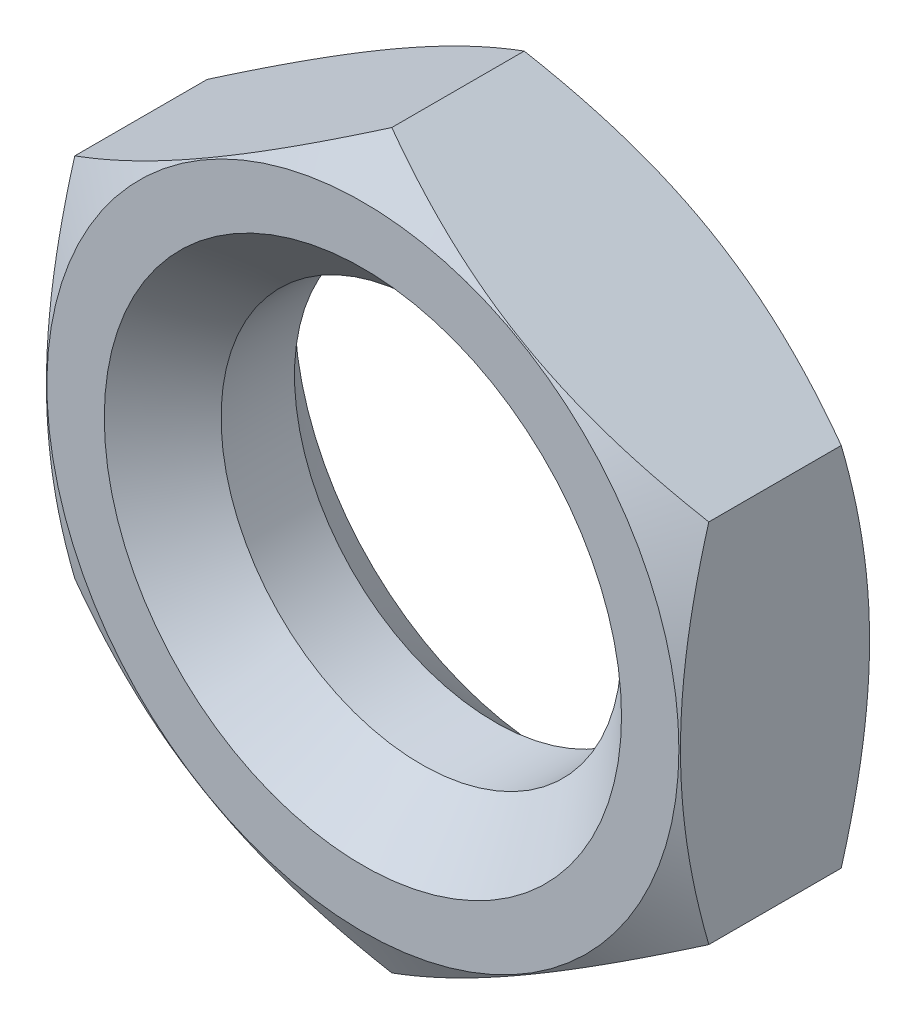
ISO-10303-21;
HEADER;
FILE_DESCRIPTION(('STEP AP214'),'2;1');
FILE_NAME('part.step','',(''),(''),'','','');
FILE_SCHEMA(('AUTOMOTIVE_DESIGN { 1 0 10303 214 1 1 1 1 }'));
ENDSEC;
DATA;
#1=APPLICATION_CONTEXT('core data for automotive mechanical design processes');
#2=APPLICATION_PROTOCOL_DEFINITION('international standard','automotive_design',2000,#1);
#3=PRODUCT_CONTEXT('',#1,'mechanical');
#4=PRODUCT('Part','Part','',(#3));
#5=PRODUCT_RELATED_PRODUCT_CATEGORY('part','',(#4));
#6=PRODUCT_DEFINITION_FORMATION('','',#4);
#7=PRODUCT_DEFINITION_CONTEXT('part definition',#1,'design');
#8=PRODUCT_DEFINITION('design','',#6,#7);
#9=PRODUCT_DEFINITION_SHAPE('','',#8);
#10=(LENGTH_UNIT() NAMED_UNIT(*) SI_UNIT(.MILLI.,.METRE.));
#11=(NAMED_UNIT(*) PLANE_ANGLE_UNIT() SI_UNIT($,.RADIAN.));
#12=(NAMED_UNIT(*) SI_UNIT($,.STERADIAN.) SOLID_ANGLE_UNIT());
#13=UNCERTAINTY_MEASURE_WITH_UNIT(LENGTH_MEASURE(1.E-05),#10,'distance_accuracy_value','');
#14=(GEOMETRIC_REPRESENTATION_CONTEXT(3) GLOBAL_UNCERTAINTY_ASSIGNED_CONTEXT((#13)) GLOBAL_UNIT_ASSIGNED_CONTEXT((#10,
#11,#12)) REPRESENTATION_CONTEXT('',''));
#15=CARTESIAN_POINT('',(0.,0.,0.));
#16=DIRECTION('',(0.,0.,1.));
#17=DIRECTION('',(1.,0.,0.));
#18=AXIS2_PLACEMENT_3D('',#15,#16,#17);
#19=CARTESIAN_POINT('',(9.5,5.48482755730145,2.85));
#20=DIRECTION('',(-0.5,-0.866025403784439,0.));
#21=DIRECTION('',(0.866025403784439,-0.5,0.));
#22=AXIS2_PLACEMENT_3D('',#19,#20,#21);
#23=PLANE('',#22);
#24=CARTESIAN_POINT('',(-0.000199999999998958,10.9697705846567,-1.98390792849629));
#25=CARTESIAN_POINT('',(0.208630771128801,10.8492020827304,-2.05350693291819));
#26=CARTESIAN_POINT('',(0.41824017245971,10.7281840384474,-2.11994706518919));
#27=CARTESIAN_POINT('',(0.839139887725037,10.4851774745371,-2.24563309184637));
#28=CARTESIAN_POINT('',(1.05043073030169,10.3631886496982,-2.30487662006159));
#29=CARTESIAN_POINT('',(1.68770779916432,9.99525656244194,-2.47066579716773));
#30=CARTESIAN_POINT('',(2.11620976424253,9.74786083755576,-2.56496593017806));
#31=CARTESIAN_POINT('',(2.75744333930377,9.37764446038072,-2.6755416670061));
#32=CARTESIAN_POINT('',(2.96825921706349,9.2559298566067,-2.70704054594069));
#33=CARTESIAN_POINT('',(3.39086703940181,9.01193711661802,-2.75986217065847));
#34=CARTESIAN_POINT('',(3.60265900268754,8.88965896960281,-2.78118472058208));
#35=CARTESIAN_POINT('',(4.02659621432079,8.64489870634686,-2.81310735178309));
#36=CARTESIAN_POINT('',(4.23874074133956,8.52241700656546,-2.82372017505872));
#37=CARTESIAN_POINT('',(4.66322575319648,8.27734047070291,-2.83399784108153));
#38=CARTESIAN_POINT('',(4.87556623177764,8.15474563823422,-2.83366302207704));
#39=CARTESIAN_POINT('',(5.27254199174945,7.92555157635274,-2.82280700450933));
#40=CARTESIAN_POINT('',(5.45720529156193,7.81893617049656,-2.81361010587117));
#41=CARTESIAN_POINT('',(5.82610000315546,7.60595470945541,-2.78711497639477));
#42=CARTESIAN_POINT('',(6.01033138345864,7.49958867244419,-2.76981617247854));
#43=CARTESIAN_POINT('',(6.562311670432,7.18090270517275,-2.70617589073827));
#44=CARTESIAN_POINT('',(6.92908353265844,6.96914687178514,-2.64809847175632));
#45=CARTESIAN_POINT('',(7.66651782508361,6.5433889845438,-2.50290435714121));
#46=CARTESIAN_POINT('',(8.03708614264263,6.32944126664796,-2.41517220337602));
#47=CARTESIAN_POINT('',(8.77269671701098,5.90473630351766,-2.21605663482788));
#48=CARTESIAN_POINT('',(9.13774839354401,5.69397361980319,-2.1047199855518));
#49=CARTESIAN_POINT('',(9.5002,5.48471208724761,-1.98390792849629));
#50=B_SPLINE_CURVE_WITH_KNOTS('',3,(#24,#25,#26,#27,#28,#29,#30,#31,#32,#33,#34,#35,#36,#37,#38,
#39,#40,#41,#42,#43,#44,#45,#46,#47,#48,#49),.UNSPECIFIED.,.F.,.F.,(4,2,2,2,2,2,2,2,2,2,2,2,4),
(0.,0.752880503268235,1.50600787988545,3.0154687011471,3.75167336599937,4.48789219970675,
5.22323407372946,5.95855322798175,6.5986808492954,7.23885375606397,8.52010929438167,
9.82978009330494,11.1368800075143),.UNSPECIFIED.);
#51=CARTESIAN_POINT('',(0.,10.9696551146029,-1.98397459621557));
#52=VERTEX_POINT('',#51);
#53=CARTESIAN_POINT('',(9.5,5.48482755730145,-1.98397459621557));
#54=VERTEX_POINT('',#53);
#55=EDGE_CURVE('E55',#52,#54,#50,.T.);
#56=ORIENTED_EDGE('',*,*,#55,.F.);
#57=DIRECTION('',(0.,0.,-1.));
#58=VECTOR('',#57,1.);
#59=CARTESIAN_POINT('',(0.,10.9696551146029,2.85));
#60=LINE('',#59,#58);
#61=CARTESIAN_POINT('',(0.,10.9696551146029,1.98397459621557));
#62=VERTEX_POINT('',#61);
#63=EDGE_CURVE('E105',#62,#52,#60,.T.);
#64=ORIENTED_EDGE('',*,*,#63,.F.);
#65=CARTESIAN_POINT('',(9.5002,5.48471208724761,1.98390792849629));
#66=CARTESIAN_POINT('',(9.2913692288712,5.6052805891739,2.05350693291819));
#67=CARTESIAN_POINT('',(9.08175982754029,5.72629863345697,2.11994706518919));
#68=CARTESIAN_POINT('',(8.66086011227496,5.96930519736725,2.24563309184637));
#69=CARTESIAN_POINT('',(8.44956926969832,6.09129402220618,2.30487662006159));
#70=CARTESIAN_POINT('',(7.81229220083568,6.4592261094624,2.47066579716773));
#71=CARTESIAN_POINT('',(7.38379023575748,6.70662183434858,2.56496593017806));
#72=CARTESIAN_POINT('',(6.74255666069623,7.07683821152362,2.6755416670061));
#73=CARTESIAN_POINT('',(6.53174078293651,7.19855281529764,2.70704054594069));
#74=CARTESIAN_POINT('',(6.10913296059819,7.44254555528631,2.75986217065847));
#75=CARTESIAN_POINT('',(5.89734099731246,7.56482370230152,2.78118472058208));
#76=CARTESIAN_POINT('',(5.47340378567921,7.80958396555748,2.81310735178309));
#77=CARTESIAN_POINT('',(5.26125925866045,7.93206566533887,2.82372017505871));
#78=CARTESIAN_POINT('',(4.83677424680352,8.17714220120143,2.83399784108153));
#79=CARTESIAN_POINT('',(4.62443376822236,8.29973703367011,2.83366302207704));
#80=CARTESIAN_POINT('',(4.22745800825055,8.5289310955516,2.82280700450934));
#81=CARTESIAN_POINT('',(4.04279470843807,8.63554650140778,2.81361010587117));
#82=CARTESIAN_POINT('',(3.67389999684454,8.84852796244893,2.78711497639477));
#83=CARTESIAN_POINT('',(3.48966861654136,8.95489399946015,2.76981617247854));
#84=CARTESIAN_POINT('',(2.937688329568,9.27357996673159,2.70617589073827));
#85=CARTESIAN_POINT('',(2.57091646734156,9.4853358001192,2.64809847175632));
#86=CARTESIAN_POINT('',(1.83348217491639,9.91109368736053,2.50290435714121));
#87=CARTESIAN_POINT('',(1.46291385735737,10.1250414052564,2.41517220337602));
#88=CARTESIAN_POINT('',(0.727303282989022,10.5497463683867,2.21605663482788));
#89=CARTESIAN_POINT('',(0.362251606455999,10.7605090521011,2.1047199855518));
#90=CARTESIAN_POINT('',(-0.000199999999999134,10.9697705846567,1.98390792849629));
#91=B_SPLINE_CURVE_WITH_KNOTS('',3,(#65,#66,#67,#68,#69,#70,#71,#72,#73,#74,#75,#76,#77,#78,#79,
#80,#81,#82,#83,#84,#85,#86,#87,#88,#89,#90),.UNSPECIFIED.,.F.,.F.,(4,2,2,2,2,2,2,2,2,2,2,2,4),
(0.,0.752880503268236,1.50600787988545,3.0154687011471,3.75167336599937,4.48789219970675,
5.22323407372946,5.95855322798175,6.5986808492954,7.23885375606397,8.52010929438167,
9.82978009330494,11.1368800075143),.UNSPECIFIED.);
#92=CARTESIAN_POINT('',(9.5,5.48482755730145,1.98397459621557));
#93=VERTEX_POINT('',#92);
#94=EDGE_CURVE('E219',#93,#62,#91,.T.);
#95=ORIENTED_EDGE('',*,*,#94,.F.);
#96=DIRECTION('',(0.,0.,-1.));
#97=VECTOR('',#96,1.);
#98=CARTESIAN_POINT('',(9.5,5.48482755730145,2.85));
#99=LINE('',#98,#97);
#100=EDGE_CURVE('E107',#93,#54,#99,.T.);
#101=ORIENTED_EDGE('',*,*,#100,.T.);
#102=EDGE_LOOP('',(#56,#64,#95,#101));
#103=FACE_BOUND('',#102,.T.);
#104=ADVANCED_FACE('F39',(#103),#23,.F.);
#105=CARTESIAN_POINT('',(0.,10.9696551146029,2.85));
#106=DIRECTION('',(0.5,-0.866025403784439,0.));
#107=DIRECTION('',(0.866025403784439,0.5,0.));
#108=AXIS2_PLACEMENT_3D('',#105,#106,#107);
#109=PLANE('',#108);
#110=CARTESIAN_POINT('',(-9.5002,5.48471208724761,-1.98390792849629));
#111=CARTESIAN_POINT('',(-9.2913692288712,5.6052805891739,-2.05350693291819));
#112=CARTESIAN_POINT('',(-9.08175982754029,5.72629863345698,-2.11994706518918));
#113=CARTESIAN_POINT('',(-8.66086011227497,5.96930519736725,-2.24563309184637));
#114=CARTESIAN_POINT('',(-8.44956926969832,6.09129402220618,-2.30487662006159));
#115=CARTESIAN_POINT('',(-7.81229220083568,6.4592261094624,-2.47066579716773));
#116=CARTESIAN_POINT('',(-7.38379023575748,6.70662183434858,-2.56496593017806));
#117=CARTESIAN_POINT('',(-6.74255666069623,7.07683821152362,-2.6755416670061));
#118=CARTESIAN_POINT('',(-6.53174078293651,7.19855281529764,-2.70704054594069));
#119=CARTESIAN_POINT('',(-6.10913296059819,7.44254555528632,-2.75986217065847));
#120=CARTESIAN_POINT('',(-5.89734099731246,7.56482370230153,-2.78118472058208));
#121=CARTESIAN_POINT('',(-5.47340378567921,7.80958396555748,-2.81310735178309));
#122=CARTESIAN_POINT('',(-5.26125925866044,7.93206566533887,-2.82372017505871));
#123=CARTESIAN_POINT('',(-4.83677424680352,8.17714220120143,-2.83399784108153));
#124=CARTESIAN_POINT('',(-4.62443376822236,8.29973703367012,-2.83366302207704));
#125=CARTESIAN_POINT('',(-4.22745800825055,8.5289310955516,-2.82280700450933));
#126=CARTESIAN_POINT('',(-4.04279470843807,8.63554650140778,-2.81361010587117));
#127=CARTESIAN_POINT('',(-3.67389999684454,8.84852796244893,-2.78711497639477));
#128=CARTESIAN_POINT('',(-3.48966861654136,8.95489399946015,-2.76981617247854));
#129=CARTESIAN_POINT('',(-2.937688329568,9.27357996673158,-2.70617589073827));
#130=CARTESIAN_POINT('',(-2.57091646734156,9.4853358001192,-2.64809847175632));
#131=CARTESIAN_POINT('',(-1.83348217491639,9.91109368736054,-2.50290435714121));
#132=CARTESIAN_POINT('',(-1.46291385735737,10.1250414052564,-2.41517220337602));
#133=CARTESIAN_POINT('',(-0.72730328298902,10.5497463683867,-2.21605663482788));
#134=CARTESIAN_POINT('',(-0.362251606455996,10.7605090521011,-2.1047199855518));
#135=CARTESIAN_POINT('',(0.000200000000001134,10.9697705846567,-1.98390792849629));
#136=B_SPLINE_CURVE_WITH_KNOTS('',3,(#110,#111,#112,#113,#114,#115,#116,#117,#118,#119,#120,
#121,#122,#123,#124,#125,#126,#127,#128,#129,#130,#131,#132,#133,#134,#135),.UNSPECIFIED.,.F.,
.F.,(4,2,2,2,2,2,2,2,2,2,2,2,4),(0.,0.752880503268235,1.50600787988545,3.0154687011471,
3.75167336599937,4.48789219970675,5.22323407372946,5.95855322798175,6.59868084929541,
7.23885375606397,8.52010929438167,9.82978009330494,11.1368800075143),.UNSPECIFIED.);
#137=CARTESIAN_POINT('',(-9.5,5.48482755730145,-1.98397459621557));
#138=VERTEX_POINT('',#137);
#139=EDGE_CURVE('E91',#138,#52,#136,.T.);
#140=ORIENTED_EDGE('',*,*,#139,.F.);
#141=DIRECTION('',(0.,0.,-1.));
#142=VECTOR('',#141,1.);
#143=CARTESIAN_POINT('',(-9.5,5.48482755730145,2.85));
#144=LINE('',#143,#142);
#145=CARTESIAN_POINT('',(-9.5,5.48482755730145,1.98397459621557));
#146=VERTEX_POINT('',#145);
#147=EDGE_CURVE('E116',#146,#138,#144,.T.);
#148=ORIENTED_EDGE('',*,*,#147,.F.);
#149=CARTESIAN_POINT('',(0.000200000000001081,10.9697705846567,1.98390792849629));
#150=CARTESIAN_POINT('',(-0.208630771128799,10.8492020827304,2.05350693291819));
#151=CARTESIAN_POINT('',(-0.418240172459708,10.7281840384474,2.11994706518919));
#152=CARTESIAN_POINT('',(-0.839139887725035,10.4851774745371,2.24563309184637));
#153=CARTESIAN_POINT('',(-1.05043073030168,10.3631886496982,2.30487662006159));
#154=CARTESIAN_POINT('',(-1.68770779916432,9.99525656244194,2.47066579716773));
#155=CARTESIAN_POINT('',(-2.11620976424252,9.74786083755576,2.56496593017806));
#156=CARTESIAN_POINT('',(-2.75744333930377,9.37764446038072,2.6755416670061));
#157=CARTESIAN_POINT('',(-2.96825921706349,9.2559298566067,2.70704054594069));
#158=CARTESIAN_POINT('',(-3.39086703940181,9.01193711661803,2.75986217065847));
#159=CARTESIAN_POINT('',(-3.60265900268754,8.88965896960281,2.78118472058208));
#160=CARTESIAN_POINT('',(-4.02659621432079,8.64489870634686,2.81310735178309));
#161=CARTESIAN_POINT('',(-4.23874074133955,8.52241700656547,2.82372017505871));
#162=CARTESIAN_POINT('',(-4.66322575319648,8.27734047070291,2.83399784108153));
#163=CARTESIAN_POINT('',(-4.87556623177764,8.15474563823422,2.83366302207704));
#164=CARTESIAN_POINT('',(-5.27254199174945,7.92555157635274,2.82280700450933));
#165=CARTESIAN_POINT('',(-5.45720529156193,7.81893617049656,2.81361010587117));
#166=CARTESIAN_POINT('',(-5.82610000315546,7.60595470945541,2.78711497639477));
#167=CARTESIAN_POINT('',(-6.01033138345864,7.49958867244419,2.76981617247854));
#168=CARTESIAN_POINT('',(-6.562311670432,7.18090270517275,2.70617589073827));
#169=CARTESIAN_POINT('',(-6.92908353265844,6.96914687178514,2.64809847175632));
#170=CARTESIAN_POINT('',(-7.66651782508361,6.5433889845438,2.50290435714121));
#171=CARTESIAN_POINT('',(-8.03708614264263,6.32944126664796,2.41517220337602));
#172=CARTESIAN_POINT('',(-8.77269671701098,5.90473630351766,2.21605663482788));
#173=CARTESIAN_POINT('',(-9.137748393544,5.69397361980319,2.1047199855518));
#174=CARTESIAN_POINT('',(-9.5002,5.48471208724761,1.98390792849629));
#175=B_SPLINE_CURVE_WITH_KNOTS('',3,(#149,#150,#151,#152,#153,#154,#155,#156,#157,#158,#159,
#160,#161,#162,#163,#164,#165,#166,#167,#168,#169,#170,#171,#172,#173,#174),.UNSPECIFIED.,.F.,
.F.,(4,2,2,2,2,2,2,2,2,2,2,2,4),(0.,0.752880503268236,1.50600787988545,3.0154687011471,
3.75167336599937,4.48789219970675,5.22323407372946,5.95855322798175,6.59868084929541,
7.23885375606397,8.52010929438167,9.82978009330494,11.1368800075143),.UNSPECIFIED.);
#176=EDGE_CURVE('E113',#62,#146,#175,.T.);
#177=ORIENTED_EDGE('',*,*,#176,.F.);
#178=ORIENTED_EDGE('',*,*,#63,.T.);
#179=EDGE_LOOP('',(#140,#148,#177,#178));
#180=FACE_BOUND('',#179,.T.);
#181=ADVANCED_FACE('F112',(#180),#109,.F.);
#182=CARTESIAN_POINT('',(-9.5,5.48482755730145,2.85));
#183=DIRECTION('',(1.,0.,0.));
#184=DIRECTION('',(0.,0.,-1.));
#185=AXIS2_PLACEMENT_3D('',#182,#183,#184);
#186=PLANE('',#185);
#187=CARTESIAN_POINT('',(-9.5,-14.5441411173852,1.71234877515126));
#188=CARTESIAN_POINT('',(-9.5,-14.3356064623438,1.6115512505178));
#189=CARTESIAN_POINT('',(-9.5,-14.1268196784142,1.51127559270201));
#190=CARTESIAN_POINT('',(-9.5,-13.7086885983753,1.31188780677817));
#191=CARTESIAN_POINT('',(-9.5,-13.499344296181,1.2127756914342));
#192=CARTESIAN_POINT('',(-9.5,-12.8703338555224,0.917335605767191));
#193=CARTESIAN_POINT('',(-9.5,-12.4497580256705,0.722936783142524));
#194=CARTESIAN_POINT('',(-9.5,-11.6032912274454,0.339426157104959));
#195=CARTESIAN_POINT('',(-9.5,-11.1773836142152,0.150350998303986));
#196=CARTESIAN_POINT('',(-9.5,-10.3220676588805,-0.21967779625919));
#197=CARTESIAN_POINT('',(-9.5,-9.89265950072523,-0.400631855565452));
#198=CARTESIAN_POINT('',(-9.5,-9.02433880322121,-0.754397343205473));
#199=CARTESIAN_POINT('',(-9.5,-8.58537427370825,-0.927081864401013));
#200=CARTESIAN_POINT('',(-9.5,-7.7022679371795,-1.25892058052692));
#201=CARTESIAN_POINT('',(-9.5,-7.25812556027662,-1.41807326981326));
#202=CARTESIAN_POINT('',(-9.5,-6.36486440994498,-1.71856922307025));
#203=CARTESIAN_POINT('',(-9.5,-5.91575852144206,-1.85995037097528));
#204=CARTESIAN_POINT('',(-9.5,-5.01117837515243,-2.12031248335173));
#205=CARTESIAN_POINT('',(-9.5,-4.55570618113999,-2.23930053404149));
#206=CARTESIAN_POINT('',(-9.5,-3.63800520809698,-2.44908988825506));
#207=CARTESIAN_POINT('',(-9.5,-3.17577463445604,-2.53988355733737));
#208=CARTESIAN_POINT('',(-9.5,-2.47836338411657,-2.65038075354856));
#209=CARTESIAN_POINT('',(-9.5,-2.24518677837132,-2.68293333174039));
#210=CARTESIAN_POINT('',(-9.5,-1.77774118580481,-2.73883350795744));
#211=CARTESIAN_POINT('',(-9.5,-1.54347230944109,-2.76218201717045));
#212=CARTESIAN_POINT('',(-9.5,-1.07564354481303,-2.79904583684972));
#213=CARTESIAN_POINT('',(-9.5,-0.842088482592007,-2.81262214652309));
#214=CARTESIAN_POINT('',(-9.5,-0.374613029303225,-2.82986982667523));
#215=CARTESIAN_POINT('',(-9.5,-0.140692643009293,-2.83354132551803));
#216=CARTESIAN_POINT('',(-9.5,0.327026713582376,-2.83089191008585));
#217=CARTESIAN_POINT('',(-9.5,0.560825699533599,-2.8245737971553));
#218=CARTESIAN_POINT('',(-9.5,1.02795364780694,-2.80210220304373));
#219=CARTESIAN_POINT('',(-9.5,1.26128258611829,-2.78594823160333));
#220=CARTESIAN_POINT('',(-9.5,1.82687816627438,-2.735206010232));
#221=CARTESIAN_POINT('',(-9.5,2.15870953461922,-2.69568528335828));
#222=CARTESIAN_POINT('',(-9.5,2.81982783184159,-2.59894476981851));
#223=CARTESIAN_POINT('',(-9.5,3.14911404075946,-2.54172015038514));
#224=CARTESIAN_POINT('',(-9.5,3.80487091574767,-2.41160145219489));
#225=CARTESIAN_POINT('',(-9.5,4.1313386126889,-2.33869255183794));
#226=CARTESIAN_POINT('',(-9.5,4.78091434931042,-2.17942968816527));
#227=CARTESIAN_POINT('',(-9.5,5.10402270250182,-2.0930769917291));
#228=CARTESIAN_POINT('',(-9.5,5.75483447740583,-1.90673599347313));
#229=CARTESIAN_POINT('',(-9.5,6.08245652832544,-1.80646544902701));
#230=CARTESIAN_POINT('',(-9.5,6.73423760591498,-1.59602223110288));
#231=CARTESIAN_POINT('',(-9.5,7.05839885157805,-1.48585638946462));
#232=CARTESIAN_POINT('',(-9.5,7.70195753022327,-1.25789772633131));
#233=CARTESIAN_POINT('',(-9.5,8.02137150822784,-1.14015133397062));
#234=CARTESIAN_POINT('',(-9.5,8.65772169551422,-0.897750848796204));
#235=CARTESIAN_POINT('',(-9.5,8.97465684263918,-0.773093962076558));
#236=CARTESIAN_POINT('',(-9.5,9.29044082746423,-0.645665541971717));
#237=B_SPLINE_CURVE_WITH_KNOTS('',3,(#187,#188,#189,#190,#191,#192,#193,#194,#195,#196,#197,
#198,#199,#200,#201,#202,#203,#204,#205,#206,#207,#208,#209,#210,#211,#212,#213,#214,#215,#216,
#217,#218,#219,#220,#221,#222,#223,#224,#225,#226,#227,#228,#229,#230,#231,#232,#233,#234,#235,
#236),.UNSPECIFIED.,.F.,.F.,(4,2,2,2,2,2,2,2,2,2,2,2,2,2,2,2,2,2,2,2,2,2,2,2,4),(0.,
0.694852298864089,1.38971221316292,2.77965820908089,4.17756254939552,5.57539389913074,
6.99034929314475,8.40546191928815,9.81750483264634,11.2291001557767,12.6410773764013,
13.3472378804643,14.0533284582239,14.754972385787,15.4566072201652,16.1580453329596,
16.859518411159,17.8614895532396,18.8637344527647,19.866930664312,20.8700323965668,
21.897710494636,22.9246844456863,23.9458768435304,24.9674851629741),.UNSPECIFIED.);
#238=CARTESIAN_POINT('',(-9.5,-5.48482755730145,-1.98397459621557));
#239=VERTEX_POINT('',#238);
#240=EDGE_CURVE('E94',#239,#138,#237,.T.);
#241=ORIENTED_EDGE('',*,*,#240,.F.);
#242=DIRECTION('',(0.,0.,-1.));
#243=VECTOR('',#242,1.);
#244=CARTESIAN_POINT('',(-9.5,-5.48482755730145,2.85));
#245=LINE('',#244,#243);
#246=CARTESIAN_POINT('',(-9.5,-5.48482755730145,1.98397459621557));
#247=VERTEX_POINT('',#246);
#248=EDGE_CURVE('E125',#247,#239,#245,.T.);
#249=ORIENTED_EDGE('',*,*,#248,.F.);
#250=CARTESIAN_POINT('',(-9.5,-14.5441411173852,-1.71234877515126));
#251=CARTESIAN_POINT('',(-9.5,-14.3356064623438,-1.6115512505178));
#252=CARTESIAN_POINT('',(-9.5,-14.1268196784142,-1.51127559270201));
#253=CARTESIAN_POINT('',(-9.5,-13.7086885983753,-1.31188780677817));
#254=CARTESIAN_POINT('',(-9.5,-13.499344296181,-1.2127756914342));
#255=CARTESIAN_POINT('',(-9.5,-12.8703338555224,-0.917335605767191));
#256=CARTESIAN_POINT('',(-9.5,-12.4497580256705,-0.722936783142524));
#257=CARTESIAN_POINT('',(-9.5,-11.6032912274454,-0.339426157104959));
#258=CARTESIAN_POINT('',(-9.5,-11.1773836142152,-0.150350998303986));
#259=CARTESIAN_POINT('',(-9.5,-10.3220676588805,0.21967779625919));
#260=CARTESIAN_POINT('',(-9.5,-9.89265950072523,0.400631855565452));
#261=CARTESIAN_POINT('',(-9.5,-9.02433880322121,0.754397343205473));
#262=CARTESIAN_POINT('',(-9.5,-8.58537427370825,0.927081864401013));
#263=CARTESIAN_POINT('',(-9.5,-7.7022679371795,1.25892058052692));
#264=CARTESIAN_POINT('',(-9.5,-7.25812556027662,1.41807326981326));
#265=CARTESIAN_POINT('',(-9.5,-6.36486440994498,1.71856922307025));
#266=CARTESIAN_POINT('',(-9.5,-5.91575852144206,1.85995037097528));
#267=CARTESIAN_POINT('',(-9.5,-5.01117837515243,2.12031248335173));
#268=CARTESIAN_POINT('',(-9.5,-4.55570618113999,2.23930053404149));
#269=CARTESIAN_POINT('',(-9.5,-3.63800520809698,2.44908988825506));
#270=CARTESIAN_POINT('',(-9.5,-3.17577463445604,2.53988355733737));
#271=CARTESIAN_POINT('',(-9.5,-2.47836338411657,2.65038075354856));
#272=CARTESIAN_POINT('',(-9.5,-2.24518677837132,2.68293333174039));
#273=CARTESIAN_POINT('',(-9.5,-1.77774118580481,2.73883350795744));
#274=CARTESIAN_POINT('',(-9.5,-1.54347230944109,2.76218201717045));
#275=CARTESIAN_POINT('',(-9.5,-1.07564354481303,2.79904583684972));
#276=CARTESIAN_POINT('',(-9.5,-0.842088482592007,2.81262214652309));
#277=CARTESIAN_POINT('',(-9.5,-0.374613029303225,2.82986982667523));
#278=CARTESIAN_POINT('',(-9.5,-0.140692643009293,2.83354132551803));
#279=CARTESIAN_POINT('',(-9.5,0.327026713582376,2.83089191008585));
#280=CARTESIAN_POINT('',(-9.5,0.560825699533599,2.8245737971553));
#281=CARTESIAN_POINT('',(-9.5,1.02795364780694,2.80210220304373));
#282=CARTESIAN_POINT('',(-9.5,1.26128258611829,2.78594823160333));
#283=CARTESIAN_POINT('',(-9.5,1.82687816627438,2.735206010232));
#284=CARTESIAN_POINT('',(-9.5,2.15870953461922,2.69568528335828));
#285=CARTESIAN_POINT('',(-9.5,2.81982783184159,2.59894476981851));
#286=CARTESIAN_POINT('',(-9.5,3.14911404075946,2.54172015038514));
#287=CARTESIAN_POINT('',(-9.5,3.80487091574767,2.41160145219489));
#288=CARTESIAN_POINT('',(-9.5,4.1313386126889,2.33869255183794));
#289=CARTESIAN_POINT('',(-9.5,4.78091434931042,2.17942968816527));
#290=CARTESIAN_POINT('',(-9.5,5.10402270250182,2.0930769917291));
#291=CARTESIAN_POINT('',(-9.5,5.75483447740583,1.90673599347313));
#292=CARTESIAN_POINT('',(-9.5,6.08245652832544,1.80646544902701));
#293=CARTESIAN_POINT('',(-9.5,6.73423760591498,1.59602223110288));
#294=CARTESIAN_POINT('',(-9.5,7.05839885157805,1.48585638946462));
#295=CARTESIAN_POINT('',(-9.5,7.70195753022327,1.25789772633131));
#296=CARTESIAN_POINT('',(-9.5,8.02137150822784,1.14015133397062));
#297=CARTESIAN_POINT('',(-9.5,8.65772169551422,0.897750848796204));
#298=CARTESIAN_POINT('',(-9.5,8.97465684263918,0.773093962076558));
#299=CARTESIAN_POINT('',(-9.5,9.29044082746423,0.645665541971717));
#300=B_SPLINE_CURVE_WITH_KNOTS('',3,(#250,#251,#252,#253,#254,#255,#256,#257,#258,#259,#260,
#261,#262,#263,#264,#265,#266,#267,#268,#269,#270,#271,#272,#273,#274,#275,#276,#277,#278,#279,
#280,#281,#282,#283,#284,#285,#286,#287,#288,#289,#290,#291,#292,#293,#294,#295,#296,#297,#298,
#299),.UNSPECIFIED.,.F.,.F.,(4,2,2,2,2,2,2,2,2,2,2,2,2,2,2,2,2,2,2,2,2,2,2,2,4),(0.,
0.694852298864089,1.38971221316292,2.77965820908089,4.17756254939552,5.57539389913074,
6.99034929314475,8.40546191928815,9.81750483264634,11.2291001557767,12.6410773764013,
13.3472378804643,14.0533284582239,14.754972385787,15.4566072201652,16.1580453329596,
16.859518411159,17.8614895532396,18.8637344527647,19.866930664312,20.8700323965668,
21.897710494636,22.9246844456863,23.9458768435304,24.9674851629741),.UNSPECIFIED.);
#301=EDGE_CURVE('E208',#146,#247,#300,.F.);
#302=ORIENTED_EDGE('',*,*,#301,.F.);
#303=ORIENTED_EDGE('',*,*,#147,.T.);
#304=EDGE_LOOP('',(#241,#249,#302,#303));
#305=FACE_BOUND('',#304,.T.);
#306=ADVANCED_FACE('F227',(#305),#186,.F.);
#307=CARTESIAN_POINT('',(-9.5,-5.48482755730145,2.85));
#308=DIRECTION('',(0.5,0.866025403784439,0.));
#309=DIRECTION('',(-0.866025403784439,0.5,0.));
#310=AXIS2_PLACEMENT_3D('',#307,#308,#309);
#311=PLANE('',#310);
#312=CARTESIAN_POINT('',(0.000199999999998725,-10.9697705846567,-1.98390792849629));
#313=CARTESIAN_POINT('',(-0.208630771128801,-10.8492020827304,-2.05350693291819));
#314=CARTESIAN_POINT('',(-0.41824017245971,-10.7281840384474,-2.11994706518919));
#315=CARTESIAN_POINT('',(-0.839139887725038,-10.4851774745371,-2.24563309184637));
#316=CARTESIAN_POINT('',(-1.05043073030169,-10.3631886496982,-2.30487662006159));
#317=CARTESIAN_POINT('',(-1.68770779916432,-9.99525656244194,-2.47066579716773));
#318=CARTESIAN_POINT('',(-2.11620976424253,-9.74786083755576,-2.56496593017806));
#319=CARTESIAN_POINT('',(-2.75744333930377,-9.37764446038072,-2.6755416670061));
#320=CARTESIAN_POINT('',(-2.96825921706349,-9.2559298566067,-2.70704054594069));
#321=CARTESIAN_POINT('',(-3.39086703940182,-9.01193711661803,-2.75986217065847));
#322=CARTESIAN_POINT('',(-3.60265900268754,-8.88965896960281,-2.78118472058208));
#323=CARTESIAN_POINT('',(-4.02659621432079,-8.64489870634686,-2.81310735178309));
#324=CARTESIAN_POINT('',(-4.23874074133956,-8.52241700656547,-2.82372017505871));
#325=CARTESIAN_POINT('',(-4.66322575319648,-8.27734047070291,-2.83399784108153));
#326=CARTESIAN_POINT('',(-4.87556623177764,-8.15474563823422,-2.83366302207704));
#327=CARTESIAN_POINT('',(-5.27254199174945,-7.92555157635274,-2.82280700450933));
#328=CARTESIAN_POINT('',(-5.45720529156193,-7.81893617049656,-2.81361010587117));
#329=CARTESIAN_POINT('',(-5.82610000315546,-7.60595470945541,-2.78711497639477));
#330=CARTESIAN_POINT('',(-6.01033138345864,-7.49958867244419,-2.76981617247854));
#331=CARTESIAN_POINT('',(-6.562311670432,-7.18090270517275,-2.70617589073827));
#332=CARTESIAN_POINT('',(-6.92908353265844,-6.96914687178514,-2.64809847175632));
#333=CARTESIAN_POINT('',(-7.66651782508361,-6.5433889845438,-2.50290435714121));
#334=CARTESIAN_POINT('',(-8.03708614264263,-6.32944126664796,-2.41517220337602));
#335=CARTESIAN_POINT('',(-8.77269671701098,-5.90473630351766,-2.21605663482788));
#336=CARTESIAN_POINT('',(-9.13774839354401,-5.69397361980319,-2.1047199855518));
#337=CARTESIAN_POINT('',(-9.5002,-5.48471208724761,-1.98390792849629));
#338=B_SPLINE_CURVE_WITH_KNOTS('',3,(#312,#313,#314,#315,#316,#317,#318,#319,#320,#321,#322,
#323,#324,#325,#326,#327,#328,#329,#330,#331,#332,#333,#334,#335,#336,#337),.UNSPECIFIED.,.F.,
.F.,(4,2,2,2,2,2,2,2,2,2,2,2,4),(0.,0.752880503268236,1.50600787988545,3.0154687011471,
3.75167336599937,4.48789219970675,5.22323407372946,5.95855322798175,6.59868084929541,
7.23885375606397,8.52010929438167,9.82978009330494,11.1368800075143),.UNSPECIFIED.);
#339=CARTESIAN_POINT('',(0.,-10.9696551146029,-1.98397459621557));
#340=VERTEX_POINT('',#339);
#341=EDGE_CURVE('E242',#340,#239,#338,.T.);
#342=ORIENTED_EDGE('',*,*,#341,.F.);
#343=DIRECTION('',(0.,0.,-1.));
#344=VECTOR('',#343,1.);
#345=CARTESIAN_POINT('',(0.,-10.9696551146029,2.85));
#346=LINE('',#345,#344);
#347=CARTESIAN_POINT('',(0.,-10.9696551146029,1.98397459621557));
#348=VERTEX_POINT('',#347);
#349=EDGE_CURVE('E362',#348,#340,#346,.T.);
#350=ORIENTED_EDGE('',*,*,#349,.F.);
#351=CARTESIAN_POINT('',(-9.5002,-5.48471208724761,1.98390792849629));
#352=CARTESIAN_POINT('',(-9.2913692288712,-5.6052805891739,2.05350693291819));
#353=CARTESIAN_POINT('',(-9.08175982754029,-5.72629863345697,2.11994706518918));
#354=CARTESIAN_POINT('',(-8.66086011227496,-5.96930519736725,2.24563309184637));
#355=CARTESIAN_POINT('',(-8.44956926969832,-6.09129402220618,2.30487662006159));
#356=CARTESIAN_POINT('',(-7.81229220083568,-6.4592261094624,2.47066579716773));
#357=CARTESIAN_POINT('',(-7.38379023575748,-6.70662183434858,2.56496593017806));
#358=CARTESIAN_POINT('',(-6.74255666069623,-7.07683821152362,2.6755416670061));
#359=CARTESIAN_POINT('',(-6.53174078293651,-7.19855281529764,2.70704054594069));
#360=CARTESIAN_POINT('',(-6.10913296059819,-7.44254555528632,2.75986217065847));
#361=CARTESIAN_POINT('',(-5.89734099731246,-7.56482370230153,2.78118472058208));
#362=CARTESIAN_POINT('',(-5.47340378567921,-7.80958396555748,2.81310735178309));
#363=CARTESIAN_POINT('',(-5.26125925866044,-7.93206566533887,2.82372017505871));
#364=CARTESIAN_POINT('',(-4.83677424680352,-8.17714220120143,2.83399784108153));
#365=CARTESIAN_POINT('',(-4.62443376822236,-8.29973703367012,2.83366302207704));
#366=CARTESIAN_POINT('',(-4.22745800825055,-8.5289310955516,2.82280700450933));
#367=CARTESIAN_POINT('',(-4.04279470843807,-8.63554650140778,2.81361010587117));
#368=CARTESIAN_POINT('',(-3.67389999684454,-8.84852796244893,2.78711497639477));
#369=CARTESIAN_POINT('',(-3.48966861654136,-8.95489399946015,2.76981617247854));
#370=CARTESIAN_POINT('',(-2.937688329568,-9.27357996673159,2.70617589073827));
#371=CARTESIAN_POINT('',(-2.57091646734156,-9.4853358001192,2.64809847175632));
#372=CARTESIAN_POINT('',(-1.83348217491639,-9.91109368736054,2.50290435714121));
#373=CARTESIAN_POINT('',(-1.46291385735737,-10.1250414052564,2.41517220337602));
#374=CARTESIAN_POINT('',(-0.727303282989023,-10.5497463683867,2.21605663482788));
#375=CARTESIAN_POINT('',(-0.362251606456,-10.7605090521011,2.1047199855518));
#376=CARTESIAN_POINT('',(0.000199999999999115,-10.9697705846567,1.98390792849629));
#377=B_SPLINE_CURVE_WITH_KNOTS('',3,(#351,#352,#353,#354,#355,#356,#357,#358,#359,#360,#361,
#362,#363,#364,#365,#366,#367,#368,#369,#370,#371,#372,#373,#374,#375,#376),.UNSPECIFIED.,.F.,
.F.,(4,2,2,2,2,2,2,2,2,2,2,2,4),(0.,0.752880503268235,1.50600787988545,3.0154687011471,
3.75167336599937,4.48789219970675,5.22323407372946,5.95855322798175,6.59868084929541,
7.23885375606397,8.52010929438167,9.82978009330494,11.1368800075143),.UNSPECIFIED.);
#378=EDGE_CURVE('E203',#247,#348,#377,.T.);
#379=ORIENTED_EDGE('',*,*,#378,.F.);
#380=ORIENTED_EDGE('',*,*,#248,.T.);
#381=EDGE_LOOP('',(#342,#350,#379,#380));
#382=FACE_BOUND('',#381,.T.);
#383=ADVANCED_FACE('F246',(#382),#311,.F.);
#384=CARTESIAN_POINT('',(0.,-10.9696551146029,2.85));
#385=DIRECTION('',(-0.5,0.866025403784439,0.));
#386=DIRECTION('',(-0.866025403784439,-0.5,0.));
#387=AXIS2_PLACEMENT_3D('',#384,#385,#386);
#388=PLANE('',#387);
#389=CARTESIAN_POINT('',(9.5002,-5.48471208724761,-1.98390792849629));
#390=CARTESIAN_POINT('',(9.2913692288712,-5.6052805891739,-2.05350693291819));
#391=CARTESIAN_POINT('',(9.08175982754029,-5.72629863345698,-2.11994706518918));
#392=CARTESIAN_POINT('',(8.66086011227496,-5.96930519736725,-2.24563309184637));
#393=CARTESIAN_POINT('',(8.44956926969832,-6.09129402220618,-2.30487662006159));
#394=CARTESIAN_POINT('',(7.81229220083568,-6.4592261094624,-2.47066579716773));
#395=CARTESIAN_POINT('',(7.38379023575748,-6.70662183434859,-2.56496593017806));
#396=CARTESIAN_POINT('',(6.74255666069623,-7.07683821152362,-2.6755416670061));
#397=CARTESIAN_POINT('',(6.53174078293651,-7.19855281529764,-2.70704054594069));
#398=CARTESIAN_POINT('',(6.10913296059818,-7.44254555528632,-2.75986217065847));
#399=CARTESIAN_POINT('',(5.89734099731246,-7.56482370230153,-2.78118472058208));
#400=CARTESIAN_POINT('',(5.47340378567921,-7.80958396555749,-2.81310735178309));
#401=CARTESIAN_POINT('',(5.26125925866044,-7.93206566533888,-2.82372017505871));
#402=CARTESIAN_POINT('',(4.83677424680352,-8.17714220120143,-2.83399784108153));
#403=CARTESIAN_POINT('',(4.62443376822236,-8.29973703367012,-2.83366302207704));
#404=CARTESIAN_POINT('',(4.22745800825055,-8.5289310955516,-2.82280700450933));
#405=CARTESIAN_POINT('',(4.04279470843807,-8.63554650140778,-2.81361010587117));
#406=CARTESIAN_POINT('',(3.67389999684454,-8.84852796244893,-2.78711497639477));
#407=CARTESIAN_POINT('',(3.48966861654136,-8.95489399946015,-2.76981617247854));
#408=CARTESIAN_POINT('',(2.937688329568,-9.27357996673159,-2.70617589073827));
#409=CARTESIAN_POINT('',(2.57091646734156,-9.4853358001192,-2.64809847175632));
#410=CARTESIAN_POINT('',(1.83348217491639,-9.91109368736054,-2.5029043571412));
#411=CARTESIAN_POINT('',(1.46291385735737,-10.1250414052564,-2.41517220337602));
#412=CARTESIAN_POINT('',(0.727303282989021,-10.5497463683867,-2.21605663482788));
#413=CARTESIAN_POINT('',(0.362251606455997,-10.7605090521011,-2.1047199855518));
#414=CARTESIAN_POINT('',(-0.000200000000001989,-10.9697705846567,-1.98390792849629));
#415=B_SPLINE_CURVE_WITH_KNOTS('',3,(#389,#390,#391,#392,#393,#394,#395,#396,#397,#398,#399,
#400,#401,#402,#403,#404,#405,#406,#407,#408,#409,#410,#411,#412,#413,#414),.UNSPECIFIED.,.F.,
.F.,(4,2,2,2,2,2,2,2,2,2,2,2,4),(0.,0.752880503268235,1.50600787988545,3.0154687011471,
3.75167336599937,4.48789219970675,5.22323407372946,5.95855322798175,6.59868084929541,
7.23885375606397,8.52010929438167,9.82978009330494,11.1368800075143),.UNSPECIFIED.);
#416=CARTESIAN_POINT('',(9.5,-5.48482755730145,-1.98397459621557));
#417=VERTEX_POINT('',#416);
#418=EDGE_CURVE('E155',#417,#340,#415,.T.);
#419=ORIENTED_EDGE('',*,*,#418,.F.);
#420=DIRECTION('',(0.,0.,-1.));
#421=VECTOR('',#420,1.);
#422=CARTESIAN_POINT('',(9.5,-5.48482755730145,2.85));
#423=LINE('',#422,#421);
#424=CARTESIAN_POINT('',(9.5,-5.48482755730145,1.98397459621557));
#425=VERTEX_POINT('',#424);
#426=EDGE_CURVE('E364',#425,#417,#423,.T.);
#427=ORIENTED_EDGE('',*,*,#426,.F.);
#428=CARTESIAN_POINT('',(-0.000200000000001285,-10.9697705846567,1.98390792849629));
#429=CARTESIAN_POINT('',(0.208630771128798,-10.8492020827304,2.05350693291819));
#430=CARTESIAN_POINT('',(0.418240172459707,-10.7281840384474,2.11994706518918));
#431=CARTESIAN_POINT('',(0.839139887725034,-10.4851774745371,2.24563309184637));
#432=CARTESIAN_POINT('',(1.05043073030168,-10.3631886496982,2.30487662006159));
#433=CARTESIAN_POINT('',(1.68770779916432,-9.99525656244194,2.47066579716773));
#434=CARTESIAN_POINT('',(2.11620976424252,-9.74786083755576,2.56496593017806));
#435=CARTESIAN_POINT('',(2.75744333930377,-9.37764446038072,2.6755416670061));
#436=CARTESIAN_POINT('',(2.96825921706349,-9.2559298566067,2.70704054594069));
#437=CARTESIAN_POINT('',(3.39086703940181,-9.01193711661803,2.75986217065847));
#438=CARTESIAN_POINT('',(3.60265900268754,-8.88965896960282,2.78118472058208));
#439=CARTESIAN_POINT('',(4.02659621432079,-8.64489870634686,2.81310735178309));
#440=CARTESIAN_POINT('',(4.23874074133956,-8.52241700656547,2.82372017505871));
#441=CARTESIAN_POINT('',(4.66322575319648,-8.27734047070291,2.83399784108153));
#442=CARTESIAN_POINT('',(4.87556623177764,-8.15474563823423,2.83366302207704));
#443=CARTESIAN_POINT('',(5.27254199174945,-7.92555157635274,2.82280700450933));
#444=CARTESIAN_POINT('',(5.45720529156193,-7.81893617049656,2.81361010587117));
#445=CARTESIAN_POINT('',(5.82610000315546,-7.60595470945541,2.78711497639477));
#446=CARTESIAN_POINT('',(6.01033138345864,-7.49958867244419,2.76981617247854));
#447=CARTESIAN_POINT('',(6.562311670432,-7.18090270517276,2.70617589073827));
#448=CARTESIAN_POINT('',(6.92908353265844,-6.96914687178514,2.64809847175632));
#449=CARTESIAN_POINT('',(7.66651782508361,-6.54338898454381,2.5029043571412));
#450=CARTESIAN_POINT('',(8.03708614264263,-6.32944126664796,2.41517220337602));
#451=CARTESIAN_POINT('',(8.77269671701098,-5.90473630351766,2.21605663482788));
#452=CARTESIAN_POINT('',(9.137748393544,-5.6939736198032,2.1047199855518));
#453=CARTESIAN_POINT('',(9.5002,-5.48471208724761,1.98390792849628));
#454=B_SPLINE_CURVE_WITH_KNOTS('',3,(#428,#429,#430,#431,#432,#433,#434,#435,#436,#437,#438,
#439,#440,#441,#442,#443,#444,#445,#446,#447,#448,#449,#450,#451,#452,#453),.UNSPECIFIED.,.F.,
.F.,(4,2,2,2,2,2,2,2,2,2,2,2,4),(0.,0.752880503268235,1.50600787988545,3.0154687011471,
3.75167336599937,4.48789219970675,5.22323407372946,5.95855322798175,6.59868084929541,
7.23885375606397,8.52010929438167,9.82978009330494,11.1368800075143),.UNSPECIFIED.);
#455=EDGE_CURVE('E63',#348,#425,#454,.T.);
#456=ORIENTED_EDGE('',*,*,#455,.F.);
#457=ORIENTED_EDGE('',*,*,#349,.T.);
#458=EDGE_LOOP('',(#419,#427,#456,#457));
#459=FACE_BOUND('',#458,.T.);
#460=ADVANCED_FACE('F175',(#459),#388,.F.);
#461=CARTESIAN_POINT('',(9.5,-5.48482755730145,2.85));
#462=DIRECTION('',(-1.,0.,0.));
#463=DIRECTION('',(0.,0.,1.));
#464=AXIS2_PLACEMENT_3D('',#461,#462,#463);
#465=PLANE('',#464);
#466=CARTESIAN_POINT('',(9.5,-14.5441411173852,1.71234877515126));
#467=CARTESIAN_POINT('',(9.5,-14.3356064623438,1.6115512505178));
#468=CARTESIAN_POINT('',(9.5,-14.1268196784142,1.51127559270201));
#469=CARTESIAN_POINT('',(9.5,-13.7086885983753,1.31188780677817));
#470=CARTESIAN_POINT('',(9.5,-13.499344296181,1.2127756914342));
#471=CARTESIAN_POINT('',(9.5,-12.8703338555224,0.917335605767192));
#472=CARTESIAN_POINT('',(9.5,-12.4497580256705,0.722936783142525));
#473=CARTESIAN_POINT('',(9.5,-11.6032912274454,0.33942615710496));
#474=CARTESIAN_POINT('',(9.5,-11.1773836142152,0.150350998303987));
#475=CARTESIAN_POINT('',(9.5,-10.3220676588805,-0.219677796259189));
#476=CARTESIAN_POINT('',(9.5,-9.89265950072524,-0.400631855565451));
#477=CARTESIAN_POINT('',(9.5,-9.02433880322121,-0.754397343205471));
#478=CARTESIAN_POINT('',(9.5,-8.58537427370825,-0.927081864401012));
#479=CARTESIAN_POINT('',(9.5,-7.70226793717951,-1.25892058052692));
#480=CARTESIAN_POINT('',(9.5,-7.25812556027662,-1.41807326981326));
#481=CARTESIAN_POINT('',(9.5,-6.36486440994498,-1.71856922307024));
#482=CARTESIAN_POINT('',(9.5,-5.91575852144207,-1.85995037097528));
#483=CARTESIAN_POINT('',(9.5,-5.01117837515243,-2.12031248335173));
#484=CARTESIAN_POINT('',(9.5,-4.55570618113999,-2.23930053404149));
#485=CARTESIAN_POINT('',(9.5,-3.63800520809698,-2.44908988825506));
#486=CARTESIAN_POINT('',(9.5,-3.17577463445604,-2.53988355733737));
#487=CARTESIAN_POINT('',(9.5,-2.47836338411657,-2.65038075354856));
#488=CARTESIAN_POINT('',(9.5,-2.24518677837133,-2.68293333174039));
#489=CARTESIAN_POINT('',(9.5,-1.77774118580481,-2.73883350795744));
#490=CARTESIAN_POINT('',(9.5,-1.54347230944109,-2.76218201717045));
#491=CARTESIAN_POINT('',(9.5,-1.07564354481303,-2.79904583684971));
#492=CARTESIAN_POINT('',(9.5,-0.842088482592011,-2.81262214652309));
#493=CARTESIAN_POINT('',(9.5,-0.374613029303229,-2.82986982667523));
#494=CARTESIAN_POINT('',(9.5,-0.140692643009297,-2.83354132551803));
#495=CARTESIAN_POINT('',(9.5,0.327026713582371,-2.83089191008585));
#496=CARTESIAN_POINT('',(9.5,0.560825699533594,-2.8245737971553));
#497=CARTESIAN_POINT('',(9.5,1.02795364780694,-2.80210220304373));
#498=CARTESIAN_POINT('',(9.5,1.26128258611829,-2.78594823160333));
#499=CARTESIAN_POINT('',(9.5,1.82687816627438,-2.735206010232));
#500=CARTESIAN_POINT('',(9.5,2.15870953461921,-2.69568528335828));
#501=CARTESIAN_POINT('',(9.5,2.81982783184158,-2.59894476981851));
#502=CARTESIAN_POINT('',(9.5,3.14911404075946,-2.54172015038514));
#503=CARTESIAN_POINT('',(9.5,3.80487091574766,-2.41160145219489));
#504=CARTESIAN_POINT('',(9.5,4.13133861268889,-2.33869255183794));
#505=CARTESIAN_POINT('',(9.5,4.78091434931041,-2.17942968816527));
#506=CARTESIAN_POINT('',(9.5,5.10402270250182,-2.0930769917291));
#507=CARTESIAN_POINT('',(9.5,5.75483447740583,-1.90673599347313));
#508=CARTESIAN_POINT('',(9.5,6.08245652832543,-1.80646544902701));
#509=CARTESIAN_POINT('',(9.5,6.73423760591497,-1.59602223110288));
#510=CARTESIAN_POINT('',(9.5,7.05839885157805,-1.48585638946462));
#511=CARTESIAN_POINT('',(9.5,7.70195753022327,-1.25789772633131));
#512=CARTESIAN_POINT('',(9.5,8.02137150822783,-1.14015133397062));
#513=CARTESIAN_POINT('',(9.5,8.65772169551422,-0.897750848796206));
#514=CARTESIAN_POINT('',(9.5,8.97465684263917,-0.773093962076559));
#515=CARTESIAN_POINT('',(9.5,9.29044082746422,-0.645665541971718));
#516=B_SPLINE_CURVE_WITH_KNOTS('',3,(#466,#467,#468,#469,#470,#471,#472,#473,#474,#475,#476,
#477,#478,#479,#480,#481,#482,#483,#484,#485,#486,#487,#488,#489,#490,#491,#492,#493,#494,#495,
#496,#497,#498,#499,#500,#501,#502,#503,#504,#505,#506,#507,#508,#509,#510,#511,#512,#513,#514,
#515),.UNSPECIFIED.,.F.,.F.,(4,2,2,2,2,2,2,2,2,2,2,2,2,2,2,2,2,2,2,2,2,2,2,2,4),(0.,
0.694852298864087,1.38971221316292,2.77965820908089,4.17756254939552,5.57539389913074,
6.99034929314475,8.40546191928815,9.81750483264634,11.2291001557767,12.6410773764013,
13.3472378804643,14.0533284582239,14.754972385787,15.4566072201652,16.1580453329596,
16.859518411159,17.8614895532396,18.8637344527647,19.866930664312,20.8700323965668,
21.897710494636,22.9246844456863,23.9458768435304,24.9674851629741),.UNSPECIFIED.);
#517=EDGE_CURVE('E153',#54,#417,#516,.F.);
#518=ORIENTED_EDGE('',*,*,#517,.F.);
#519=ORIENTED_EDGE('',*,*,#100,.F.);
#520=CARTESIAN_POINT('',(9.5,-14.5441411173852,-1.71234877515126));
#521=CARTESIAN_POINT('',(9.5,-14.3356064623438,-1.6115512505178));
#522=CARTESIAN_POINT('',(9.5,-14.1268196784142,-1.51127559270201));
#523=CARTESIAN_POINT('',(9.5,-13.7086885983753,-1.31188780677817));
#524=CARTESIAN_POINT('',(9.5,-13.499344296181,-1.2127756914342));
#525=CARTESIAN_POINT('',(9.5,-12.8703338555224,-0.917335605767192));
#526=CARTESIAN_POINT('',(9.5,-12.4497580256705,-0.722936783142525));
#527=CARTESIAN_POINT('',(9.5,-11.6032912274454,-0.33942615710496));
#528=CARTESIAN_POINT('',(9.5,-11.1773836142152,-0.150350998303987));
#529=CARTESIAN_POINT('',(9.5,-10.3220676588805,0.219677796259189));
#530=CARTESIAN_POINT('',(9.5,-9.89265950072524,0.400631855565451));
#531=CARTESIAN_POINT('',(9.5,-9.02433880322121,0.754397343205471));
#532=CARTESIAN_POINT('',(9.5,-8.58537427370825,0.927081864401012));
#533=CARTESIAN_POINT('',(9.5,-7.70226793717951,1.25892058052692));
#534=CARTESIAN_POINT('',(9.5,-7.25812556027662,1.41807326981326));
#535=CARTESIAN_POINT('',(9.5,-6.36486440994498,1.71856922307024));
#536=CARTESIAN_POINT('',(9.5,-5.91575852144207,1.85995037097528));
#537=CARTESIAN_POINT('',(9.5,-5.01117837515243,2.12031248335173));
#538=CARTESIAN_POINT('',(9.5,-4.55570618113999,2.23930053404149));
#539=CARTESIAN_POINT('',(9.5,-3.63800520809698,2.44908988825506));
#540=CARTESIAN_POINT('',(9.5,-3.17577463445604,2.53988355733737));
#541=CARTESIAN_POINT('',(9.5,-2.47836338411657,2.65038075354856));
#542=CARTESIAN_POINT('',(9.5,-2.24518677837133,2.68293333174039));
#543=CARTESIAN_POINT('',(9.5,-1.77774118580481,2.73883350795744));
#544=CARTESIAN_POINT('',(9.5,-1.54347230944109,2.76218201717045));
#545=CARTESIAN_POINT('',(9.5,-1.07564354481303,2.79904583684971));
#546=CARTESIAN_POINT('',(9.5,-0.842088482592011,2.81262214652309));
#547=CARTESIAN_POINT('',(9.5,-0.374613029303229,2.82986982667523));
#548=CARTESIAN_POINT('',(9.5,-0.140692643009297,2.83354132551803));
#549=CARTESIAN_POINT('',(9.5,0.327026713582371,2.83089191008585));
#550=CARTESIAN_POINT('',(9.5,0.560825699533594,2.8245737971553));
#551=CARTESIAN_POINT('',(9.5,1.02795364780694,2.80210220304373));
#552=CARTESIAN_POINT('',(9.5,1.26128258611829,2.78594823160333));
#553=CARTESIAN_POINT('',(9.5,1.82687816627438,2.735206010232));
#554=CARTESIAN_POINT('',(9.5,2.15870953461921,2.69568528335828));
#555=CARTESIAN_POINT('',(9.5,2.81982783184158,2.59894476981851));
#556=CARTESIAN_POINT('',(9.5,3.14911404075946,2.54172015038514));
#557=CARTESIAN_POINT('',(9.5,3.80487091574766,2.41160145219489));
#558=CARTESIAN_POINT('',(9.5,4.13133861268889,2.33869255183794));
#559=CARTESIAN_POINT('',(9.5,4.78091434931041,2.17942968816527));
#560=CARTESIAN_POINT('',(9.5,5.10402270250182,2.0930769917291));
#561=CARTESIAN_POINT('',(9.5,5.75483447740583,1.90673599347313));
#562=CARTESIAN_POINT('',(9.5,6.08245652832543,1.80646544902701));
#563=CARTESIAN_POINT('',(9.5,6.73423760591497,1.59602223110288));
#564=CARTESIAN_POINT('',(9.5,7.05839885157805,1.48585638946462));
#565=CARTESIAN_POINT('',(9.5,7.70195753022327,1.25789772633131));
#566=CARTESIAN_POINT('',(9.5,8.02137150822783,1.14015133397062));
#567=CARTESIAN_POINT('',(9.5,8.65772169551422,0.897750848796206));
#568=CARTESIAN_POINT('',(9.5,8.97465684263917,0.773093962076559));
#569=CARTESIAN_POINT('',(9.5,9.29044082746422,0.645665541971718));
#570=B_SPLINE_CURVE_WITH_KNOTS('',3,(#520,#521,#522,#523,#524,#525,#526,#527,#528,#529,#530,
#531,#532,#533,#534,#535,#536,#537,#538,#539,#540,#541,#542,#543,#544,#545,#546,#547,#548,#549,
#550,#551,#552,#553,#554,#555,#556,#557,#558,#559,#560,#561,#562,#563,#564,#565,#566,#567,#568,
#569),.UNSPECIFIED.,.F.,.F.,(4,2,2,2,2,2,2,2,2,2,2,2,2,2,2,2,2,2,2,2,2,2,2,2,4),(0.,
0.694852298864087,1.38971221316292,2.77965820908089,4.17756254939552,5.57539389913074,
6.99034929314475,8.40546191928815,9.81750483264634,11.2291001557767,12.6410773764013,
13.3472378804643,14.0533284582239,14.754972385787,15.4566072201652,16.1580453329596,
16.859518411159,17.8614895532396,18.8637344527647,19.866930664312,20.8700323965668,
21.897710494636,22.9246844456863,23.9458768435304,24.9674851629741),.UNSPECIFIED.);
#571=EDGE_CURVE('E182',#425,#93,#570,.T.);
#572=ORIENTED_EDGE('',*,*,#571,.F.);
#573=ORIENTED_EDGE('',*,*,#426,.T.);
#574=EDGE_LOOP('',(#518,#519,#572,#573));
#575=FACE_BOUND('',#574,.T.);
#576=ADVANCED_FACE('F171',(#575),#465,.F.);
#577=CARTESIAN_POINT('',(0.,0.,2.85));
#578=DIRECTION('',(0.,0.,-1.));
#579=DIRECTION('',(-1.,0.,0.));
#580=AXIS2_PLACEMENT_3D('',#577,#578,#579);
#581=CONICAL_SURFACE('',#580,9.46965511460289,1.0471975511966);
#582=CARTESIAN_POINT('',(0.,0.,2.85));
#583=DIRECTION('',(0.,0.,1.));
#584=DIRECTION('',(1.,0.,0.));
#585=AXIS2_PLACEMENT_3D('',#582,#583,#584);
#586=CIRCLE('',#585,9.46965511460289);
#587=CARTESIAN_POINT('',(9.46965511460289,0.,2.85));
#588=VERTEX_POINT('',#587);
#589=EDGE_CURVE('E109',#588,#588,#586,.T.);
#590=ORIENTED_EDGE('',*,*,#589,.F.);
#591=EDGE_LOOP('',(#590));
#592=FACE_BOUND('',#591,.T.);
#593=ORIENTED_EDGE('',*,*,#94,.T.);
#594=ORIENTED_EDGE('',*,*,#176,.T.);
#595=ORIENTED_EDGE('',*,*,#301,.T.);
#596=ORIENTED_EDGE('',*,*,#378,.T.);
#597=ORIENTED_EDGE('',*,*,#455,.T.);
#598=ORIENTED_EDGE('',*,*,#571,.T.);
#599=EDGE_LOOP('',(#593,#594,#595,#596,#597,#598));
#600=FACE_BOUND('',#599,.T.);
#601=ADVANCED_FACE('F174',(#592,#600),#581,.T.);
#602=CARTESIAN_POINT('',(0.,0.,2.85));
#603=DIRECTION('',(0.,0.,1.));
#604=DIRECTION('',(1.,0.,0.));
#605=AXIS2_PLACEMENT_3D('',#602,#603,#604);
#606=PLANE('',#605);
#607=CARTESIAN_POINT('',(0.,0.,2.85));
#608=DIRECTION('',(0.,0.,1.));
#609=DIRECTION('',(1.,0.,0.));
#610=AXIS2_PLACEMENT_3D('',#607,#608,#609);
#611=CIRCLE('',#610,7.75);
#612=CARTESIAN_POINT('',(7.75,0.,2.85));
#613=VERTEX_POINT('',#612);
#614=EDGE_CURVE('E11',#613,#613,#611,.F.);
#615=ORIENTED_EDGE('',*,*,#614,.T.);
#616=EDGE_LOOP('',(#615));
#617=FACE_BOUND('',#616,.T.);
#618=ORIENTED_EDGE('',*,*,#589,.T.);
#619=EDGE_LOOP('',(#618));
#620=FACE_BOUND('',#619,.T.);
#621=ADVANCED_FACE('F195',(#617,#620),#606,.T.);
#622=CARTESIAN_POINT('',(0.,0.,-2.85));
#623=DIRECTION('',(0.,0.,1.));
#624=DIRECTION('',(-1.,0.,0.));
#625=AXIS2_PLACEMENT_3D('',#622,#623,#624);
#626=CONICAL_SURFACE('',#625,9.46965511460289,1.0471975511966);
#627=CARTESIAN_POINT('',(0.,0.,-2.85));
#628=DIRECTION('',(0.,0.,1.));
#629=DIRECTION('',(1.,0.,0.));
#630=AXIS2_PLACEMENT_3D('',#627,#628,#629);
#631=CIRCLE('',#630,9.46965511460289);
#632=CARTESIAN_POINT('',(9.46965511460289,0.,-2.85));
#633=VERTEX_POINT('',#632);
#634=EDGE_CURVE('E151',#633,#633,#631,.T.);
#635=ORIENTED_EDGE('',*,*,#634,.T.);
#636=EDGE_LOOP('',(#635));
#637=FACE_BOUND('',#636,.T.);
#638=ORIENTED_EDGE('',*,*,#55,.T.);
#639=ORIENTED_EDGE('',*,*,#517,.T.);
#640=ORIENTED_EDGE('',*,*,#418,.T.);
#641=ORIENTED_EDGE('',*,*,#341,.T.);
#642=ORIENTED_EDGE('',*,*,#240,.T.);
#643=ORIENTED_EDGE('',*,*,#139,.T.);
#644=EDGE_LOOP('',(#638,#639,#640,#641,#642,#643));
#645=FACE_BOUND('',#644,.T.);
#646=ADVANCED_FACE('F92',(#637,#645),#626,.T.);
#647=CARTESIAN_POINT('',(0.,0.,-2.85));
#648=DIRECTION('',(0.,0.,1.));
#649=DIRECTION('',(1.,0.,0.));
#650=AXIS2_PLACEMENT_3D('',#647,#648,#649);
#651=PLANE('',#650);
#652=CARTESIAN_POINT('',(0.,0.,-2.85));
#653=DIRECTION('',(0.,0.,1.));
#654=DIRECTION('',(1.,0.,0.));
#655=AXIS2_PLACEMENT_3D('',#652,#653,#654);
#656=CIRCLE('',#655,7.75);
#657=CARTESIAN_POINT('',(7.75,0.,-2.85));
#658=VERTEX_POINT('',#657);
#659=EDGE_CURVE('E115',#658,#658,#656,.T.);
#660=ORIENTED_EDGE('',*,*,#659,.T.);
#661=EDGE_LOOP('',(#660));
#662=FACE_BOUND('',#661,.T.);
#663=ORIENTED_EDGE('',*,*,#634,.F.);
#664=EDGE_LOOP('',(#663));
#665=FACE_BOUND('',#664,.T.);
#666=ADVANCED_FACE('F145',(#662,#665),#651,.F.);
#667=CARTESIAN_POINT('',(0.,0.,-2.85));
#668=DIRECTION('',(0.,0.,1.));
#669=DIRECTION('',(1.,0.,0.));
#670=AXIS2_PLACEMENT_3D('',#667,#668,#669);
#671=CYLINDRICAL_SURFACE('',#670,6.);
#672=CARTESIAN_POINT('',(0.,0.,-1.09999999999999));
#673=DIRECTION('',(0.,0.,1.));
#674=DIRECTION('',(1.,0.,0.));
#675=AXIS2_PLACEMENT_3D('',#672,#673,#674);
#676=CIRCLE('',#675,6.);
#677=CARTESIAN_POINT('',(6.,0.,-1.09999999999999));
#678=VERTEX_POINT('',#677);
#679=EDGE_CURVE('E48',#678,#678,#676,.F.);
#680=CARTESIAN_POINT('',(0.,0.,1.1));
#681=DIRECTION('',(0.,0.,1.));
#682=DIRECTION('',(1.,0.,0.));
#683=AXIS2_PLACEMENT_3D('',#680,#681,#682);
#684=CIRCLE('',#683,6.);
#685=CARTESIAN_POINT('',(6.,0.,1.1));
#686=VERTEX_POINT('',#685);
#687=EDGE_CURVE('E122',#686,#686,#684,.T.);
#688=CARTESIAN_POINT('',(6.,0.,-1.09999999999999));
#689=CARTESIAN_POINT('',(6.,0.,-1.07708333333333));
#690=CARTESIAN_POINT('',(6.,0.,-1.05416666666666));
#691=CARTESIAN_POINT('',(6.,0.,-1.00833333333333));
#692=CARTESIAN_POINT('',(6.,0.,-0.985416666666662));
#693=CARTESIAN_POINT('',(6.,0.,-0.939583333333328));
#694=CARTESIAN_POINT('',(6.,0.,-0.916666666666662));
#695=CARTESIAN_POINT('',(6.,0.,-0.870833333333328));
#696=CARTESIAN_POINT('',(6.,0.,-0.847916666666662));
#697=CARTESIAN_POINT('',(6.,0.,-0.802083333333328));
#698=CARTESIAN_POINT('',(6.,0.,-0.779166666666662));
#699=CARTESIAN_POINT('',(6.,0.,-0.733333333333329));
#700=CARTESIAN_POINT('',(6.,0.,-0.710416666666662));
#701=CARTESIAN_POINT('',(6.,0.,-0.664583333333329));
#702=CARTESIAN_POINT('',(6.,0.,-0.641666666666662));
#703=CARTESIAN_POINT('',(6.,0.,-0.595833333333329));
#704=CARTESIAN_POINT('',(6.,0.,-0.572916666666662));
#705=CARTESIAN_POINT('',(6.,0.,-0.527083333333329));
#706=CARTESIAN_POINT('',(6.,0.,-0.504166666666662));
#707=CARTESIAN_POINT('',(6.,0.,-0.458333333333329));
#708=CARTESIAN_POINT('',(6.,0.,-0.435416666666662));
#709=CARTESIAN_POINT('',(6.,0.,-0.389583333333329));
#710=CARTESIAN_POINT('',(6.,0.,-0.366666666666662));
#711=CARTESIAN_POINT('',(6.,0.,-0.320833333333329));
#712=CARTESIAN_POINT('',(6.,0.,-0.297916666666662));
#713=CARTESIAN_POINT('',(6.,0.,-0.252083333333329));
#714=CARTESIAN_POINT('',(6.,0.,-0.229166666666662));
#715=CARTESIAN_POINT('',(6.,0.,-0.183333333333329));
#716=CARTESIAN_POINT('',(6.,0.,-0.160416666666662));
#717=CARTESIAN_POINT('',(6.,0.,-0.114583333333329));
#718=CARTESIAN_POINT('',(6.,0.,-0.0916666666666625));
#719=CARTESIAN_POINT('',(6.,0.,-0.0458333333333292));
#720=CARTESIAN_POINT('',(6.,0.,-0.0229166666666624));
#721=CARTESIAN_POINT('',(6.,0.,0.0229166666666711));
#722=CARTESIAN_POINT('',(6.,0.,0.0458333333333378));
#723=CARTESIAN_POINT('',(6.,0.,0.0916666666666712));
#724=CARTESIAN_POINT('',(6.,0.,0.114583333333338));
#725=CARTESIAN_POINT('',(6.,0.,0.160416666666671));
#726=CARTESIAN_POINT('',(6.,0.,0.183333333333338));
#727=CARTESIAN_POINT('',(6.,0.,0.229166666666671));
#728=CARTESIAN_POINT('',(6.,0.,0.252083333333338));
#729=CARTESIAN_POINT('',(6.,0.,0.297916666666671));
#730=CARTESIAN_POINT('',(6.,0.,0.320833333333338));
#731=CARTESIAN_POINT('',(6.,0.,0.366666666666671));
#732=CARTESIAN_POINT('',(6.,0.,0.389583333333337));
#733=CARTESIAN_POINT('',(6.,0.,0.435416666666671));
#734=CARTESIAN_POINT('',(6.,0.,0.458333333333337));
#735=CARTESIAN_POINT('',(6.,0.,0.504166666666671));
#736=CARTESIAN_POINT('',(6.,0.,0.527083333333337));
#737=CARTESIAN_POINT('',(6.,0.,0.572916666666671));
#738=CARTESIAN_POINT('',(6.,0.,0.595833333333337));
#739=CARTESIAN_POINT('',(6.,0.,0.641666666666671));
#740=CARTESIAN_POINT('',(6.,0.,0.664583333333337));
#741=CARTESIAN_POINT('',(6.,0.,0.710416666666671));
#742=CARTESIAN_POINT('',(6.,0.,0.733333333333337));
#743=CARTESIAN_POINT('',(6.,0.,0.779166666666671));
#744=CARTESIAN_POINT('',(6.,0.,0.802083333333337));
#745=CARTESIAN_POINT('',(6.,0.,0.84791666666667));
#746=CARTESIAN_POINT('',(6.,0.,0.870833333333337));
#747=CARTESIAN_POINT('',(6.,0.,0.916666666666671));
#748=CARTESIAN_POINT('',(6.,0.,0.939583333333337));
#749=CARTESIAN_POINT('',(6.,0.,0.98541666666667));
#750=CARTESIAN_POINT('',(6.,0.,1.00833333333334));
#751=CARTESIAN_POINT('',(6.,0.,1.05416666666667));
#752=CARTESIAN_POINT('',(6.,0.,1.07708333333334));
#753=CARTESIAN_POINT('',(6.,0.,1.1));
#754=B_SPLINE_CURVE_WITH_KNOTS('',3,(#688,#689,#690,#691,#692,#693,#694,#695,#696,#697,#698,
#699,#700,#701,#702,#703,#704,#705,#706,#707,#708,#709,#710,#711,#712,#713,#714,#715,#716,#717,
#718,#719,#720,#721,#722,#723,#724,#725,#726,#727,#728,#729,#730,#731,#732,#733,#734,#735,#736,
#737,#738,#739,#740,#741,#742,#743,#744,#745,#746,#747,#748,#749,#750,#751,#752,#753),
.UNSPECIFIED.,.F.,.F.,(4,2,2,2,2,2,2,2,2,2,2,2,2,2,2,2,2,2,2,2,2,2,2,2,2,2,2,2,2,2,2,2,4),(0.,
0.06875,0.1375,0.20625,0.275,0.34375,0.4125,0.48125,0.55,0.618749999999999,0.6875,0.75625,
0.824999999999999,0.89375,0.962499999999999,1.03125,1.1,1.16875,1.2375,1.30625,1.375,1.44375,
1.5125,1.58125,1.65,1.71875,1.7875,1.85625,1.925,1.99375,2.0625,2.13125,2.2),.UNSPECIFIED.);
#755=EDGE_CURVE('BSEAM137',#678,#686,#754,.T.);
#756=ORIENTED_EDGE('',*,*,#679,.T.);
#757=ORIENTED_EDGE('',*,*,#687,.T.);
#758=ORIENTED_EDGE('',*,*,#755,.T.);
#759=ORIENTED_EDGE('',*,*,#755,.F.);
#760=EDGE_LOOP('',(#756,#758,#757,#759));
#761=FACE_BOUND('',#760,.T.);
#762=ADVANCED_FACE('F137',(#761),#671,.F.);
#763=CARTESIAN_POINT('',(0.,0.,-2.85));
#764=DIRECTION('',(0.,0.,-1.));
#765=DIRECTION('',(-1.,0.,0.));
#766=AXIS2_PLACEMENT_3D('',#763,#764,#765);
#767=CONICAL_SURFACE('',#766,7.75,0.785398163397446);
#768=ORIENTED_EDGE('',*,*,#679,.F.);
#769=EDGE_LOOP('',(#768));
#770=FACE_BOUND('',#769,.T.);
#771=ORIENTED_EDGE('',*,*,#659,.F.);
#772=EDGE_LOOP('',(#771));
#773=FACE_BOUND('',#772,.T.);
#774=ADVANCED_FACE('F140',(#770,#773),#767,.F.);
#775=CARTESIAN_POINT('',(0.,0.,1.1));
#776=DIRECTION('',(0.,0.,1.));
#777=DIRECTION('',(1.,0.,0.));
#778=AXIS2_PLACEMENT_3D('',#775,#776,#777);
#779=CONICAL_SURFACE('',#778,6.,0.78539816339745);
#780=CARTESIAN_POINT('',(7.75,0.,2.85));
#781=CARTESIAN_POINT('',(7.73177083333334,0.,2.83177083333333));
#782=CARTESIAN_POINT('',(7.71354166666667,0.,2.81354166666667));
#783=CARTESIAN_POINT('',(7.67708333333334,0.,2.77708333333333));
#784=CARTESIAN_POINT('',(7.65885416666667,0.,2.75885416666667));
#785=CARTESIAN_POINT('',(7.62239583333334,0.,2.72239583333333));
#786=CARTESIAN_POINT('',(7.60416666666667,0.,2.70416666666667));
#787=CARTESIAN_POINT('',(7.56770833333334,0.,2.66770833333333));
#788=CARTESIAN_POINT('',(7.54947916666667,0.,2.64947916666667));
#789=CARTESIAN_POINT('',(7.51302083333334,0.,2.61302083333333));
#790=CARTESIAN_POINT('',(7.49479166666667,0.,2.59479166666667));
#791=CARTESIAN_POINT('',(7.45833333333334,0.,2.55833333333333));
#792=CARTESIAN_POINT('',(7.44010416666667,0.,2.54010416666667));
#793=CARTESIAN_POINT('',(7.40364583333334,0.,2.50364583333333));
#794=CARTESIAN_POINT('',(7.38541666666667,0.,2.48541666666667));
#795=CARTESIAN_POINT('',(7.34895833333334,0.,2.44895833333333));
#796=CARTESIAN_POINT('',(7.33072916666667,0.,2.43072916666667));
#797=CARTESIAN_POINT('',(7.29427083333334,0.,2.39427083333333));
#798=CARTESIAN_POINT('',(7.27604166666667,0.,2.37604166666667));
#799=CARTESIAN_POINT('',(7.23958333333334,0.,2.33958333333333));
#800=CARTESIAN_POINT('',(7.22135416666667,0.,2.32135416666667));
#801=CARTESIAN_POINT('',(7.18489583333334,0.,2.28489583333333));
#802=CARTESIAN_POINT('',(7.16666666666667,0.,2.26666666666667));
#803=CARTESIAN_POINT('',(7.13020833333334,0.,2.23020833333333));
#804=CARTESIAN_POINT('',(7.11197916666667,0.,2.21197916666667));
#805=CARTESIAN_POINT('',(7.07552083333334,0.,2.17552083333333));
#806=CARTESIAN_POINT('',(7.05729166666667,0.,2.15729166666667));
#807=CARTESIAN_POINT('',(7.02083333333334,0.,2.12083333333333));
#808=CARTESIAN_POINT('',(7.00260416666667,0.,2.10260416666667));
#809=CARTESIAN_POINT('',(6.96614583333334,0.,2.06614583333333));
#810=CARTESIAN_POINT('',(6.94791666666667,0.,2.04791666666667));
#811=CARTESIAN_POINT('',(6.91145833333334,0.,2.01145833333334));
#812=CARTESIAN_POINT('',(6.89322916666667,0.,1.99322916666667));
#813=CARTESIAN_POINT('',(6.85677083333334,0.,1.95677083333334));
#814=CARTESIAN_POINT('',(6.83854166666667,0.,1.93854166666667));
#815=CARTESIAN_POINT('',(6.80208333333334,0.,1.90208333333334));
#816=CARTESIAN_POINT('',(6.78385416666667,0.,1.88385416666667));
#817=CARTESIAN_POINT('',(6.74739583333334,0.,1.84739583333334));
#818=CARTESIAN_POINT('',(6.72916666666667,0.,1.82916666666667));
#819=CARTESIAN_POINT('',(6.69270833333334,0.,1.79270833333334));
#820=CARTESIAN_POINT('',(6.67447916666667,0.,1.77447916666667));
#821=CARTESIAN_POINT('',(6.63802083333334,0.,1.73802083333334));
#822=CARTESIAN_POINT('',(6.61979166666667,0.,1.71979166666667));
#823=CARTESIAN_POINT('',(6.58333333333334,0.,1.68333333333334));
#824=CARTESIAN_POINT('',(6.56510416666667,0.,1.66510416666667));
#825=CARTESIAN_POINT('',(6.52864583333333,0.,1.62864583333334));
#826=CARTESIAN_POINT('',(6.51041666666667,0.,1.61041666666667));
#827=CARTESIAN_POINT('',(6.47395833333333,0.,1.57395833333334));
#828=CARTESIAN_POINT('',(6.45572916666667,0.,1.55572916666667));
#829=CARTESIAN_POINT('',(6.41927083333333,0.,1.51927083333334));
#830=CARTESIAN_POINT('',(6.40104166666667,0.,1.50104166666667));
#831=CARTESIAN_POINT('',(6.36458333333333,0.,1.46458333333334));
#832=CARTESIAN_POINT('',(6.34635416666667,0.,1.44635416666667));
#833=CARTESIAN_POINT('',(6.30989583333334,0.,1.40989583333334));
#834=CARTESIAN_POINT('',(6.29166666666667,0.,1.39166666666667));
#835=CARTESIAN_POINT('',(6.25520833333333,0.,1.35520833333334));
#836=CARTESIAN_POINT('',(6.23697916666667,0.,1.33697916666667));
#837=CARTESIAN_POINT('',(6.20052083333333,0.,1.30052083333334));
#838=CARTESIAN_POINT('',(6.18229166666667,0.,1.28229166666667));
#839=CARTESIAN_POINT('',(6.14583333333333,0.,1.24583333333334));
#840=CARTESIAN_POINT('',(6.12760416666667,0.,1.22760416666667));
#841=CARTESIAN_POINT('',(6.09114583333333,0.,1.19114583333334));
#842=CARTESIAN_POINT('',(6.07291666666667,0.,1.17291666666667));
#843=CARTESIAN_POINT('',(6.03645833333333,0.,1.13645833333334));
#844=CARTESIAN_POINT('',(6.01822916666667,0.,1.11822916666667));
#845=CARTESIAN_POINT('',(6.,0.,1.1));
#846=B_SPLINE_CURVE_WITH_KNOTS('',3,(#780,#781,#782,#783,#784,#785,#786,#787,#788,#789,#790,
#791,#792,#793,#794,#795,#796,#797,#798,#799,#800,#801,#802,#803,#804,#805,#806,#807,#808,#809,
#810,#811,#812,#813,#814,#815,#816,#817,#818,#819,#820,#821,#822,#823,#824,#825,#826,#827,#828,
#829,#830,#831,#832,#833,#834,#835,#836,#837,#838,#839,#840,#841,#842,#843,#844,#845),
.UNSPECIFIED.,.F.,.F.,(4,2,2,2,2,2,2,2,2,2,2,2,2,2,2,2,2,2,2,2,2,2,2,2,2,2,2,2,2,2,2,2,4),(0.,
0.0773398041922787,0.154679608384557,0.232019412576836,0.309359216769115,0.386699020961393,
0.464038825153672,0.54137862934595,0.61871843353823,0.696058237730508,0.773398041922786,
0.850737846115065,0.928077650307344,1.00541745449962,1.0827572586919,1.16009706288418,
1.23743686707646,1.31477667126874,1.39211647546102,1.46945627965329,1.54679608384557,
1.62413588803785,1.70147569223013,1.77881549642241,1.85615530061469,1.93349510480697,
2.01083490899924,2.08817471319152,2.1655145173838,2.24285432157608,2.32019412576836,
2.39753392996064,2.47487373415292),.UNSPECIFIED.);
#847=EDGE_CURVE('BSEAM41',#613,#686,#846,.T.);
#848=ORIENTED_EDGE('',*,*,#614,.F.);
#849=ORIENTED_EDGE('',*,*,#687,.F.);
#850=ORIENTED_EDGE('',*,*,#847,.T.);
#851=ORIENTED_EDGE('',*,*,#847,.F.);
#852=EDGE_LOOP('',(#848,#850,#849,#851));
#853=FACE_BOUND('',#852,.T.);
#854=ADVANCED_FACE('F41',(#853),#779,.F.);
#855=CLOSED_SHELL('',(#104,#181,#306,#383,#460,#576,#601,#621,#646,#666,#762,#774,#854));
#856=MANIFOLD_SOLID_BREP('B2',#855);
#857=ADVANCED_BREP_SHAPE_REPRESENTATION('',(#18,#856),#14);
#858=SHAPE_DEFINITION_REPRESENTATION(#9,#857);
ENDSEC;
END-ISO-10303-21;
